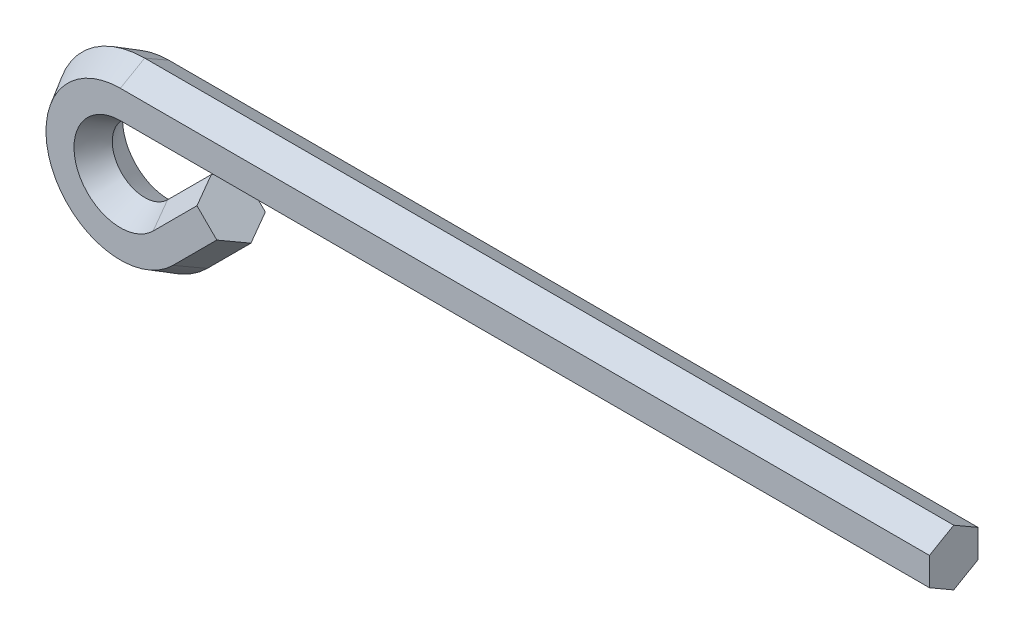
from build123d import *


with BuildPart() as part:
    # Base-Sweep: sweep along a path in Sketch1
    with BuildLine(Plane.XY) as base_sweep_path:
        Line((100, 4), (0, 4))
        ThreePointArc((0, 4), (-3.69551813, -1.530733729), (2.828427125, -2.828427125))
        Line((2.828427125, -2.828427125), (8.242640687, 2.585786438))
    # Sketch2 → Base-Sweep (sweep)
    with BuildSketch(Plane(origin=(100, 4, 0), x_dir=(0, 0, 1), z_dir=(-1, 0, 0))):
        Polygon((-3, 5.196152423), (0, 6.92820323), (3, 5.196152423), (3, 1.732050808), (0, 0), (-3, 1.732050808), align=None)
    sweep(path=base_sweep_path.line)


solid = part.part
